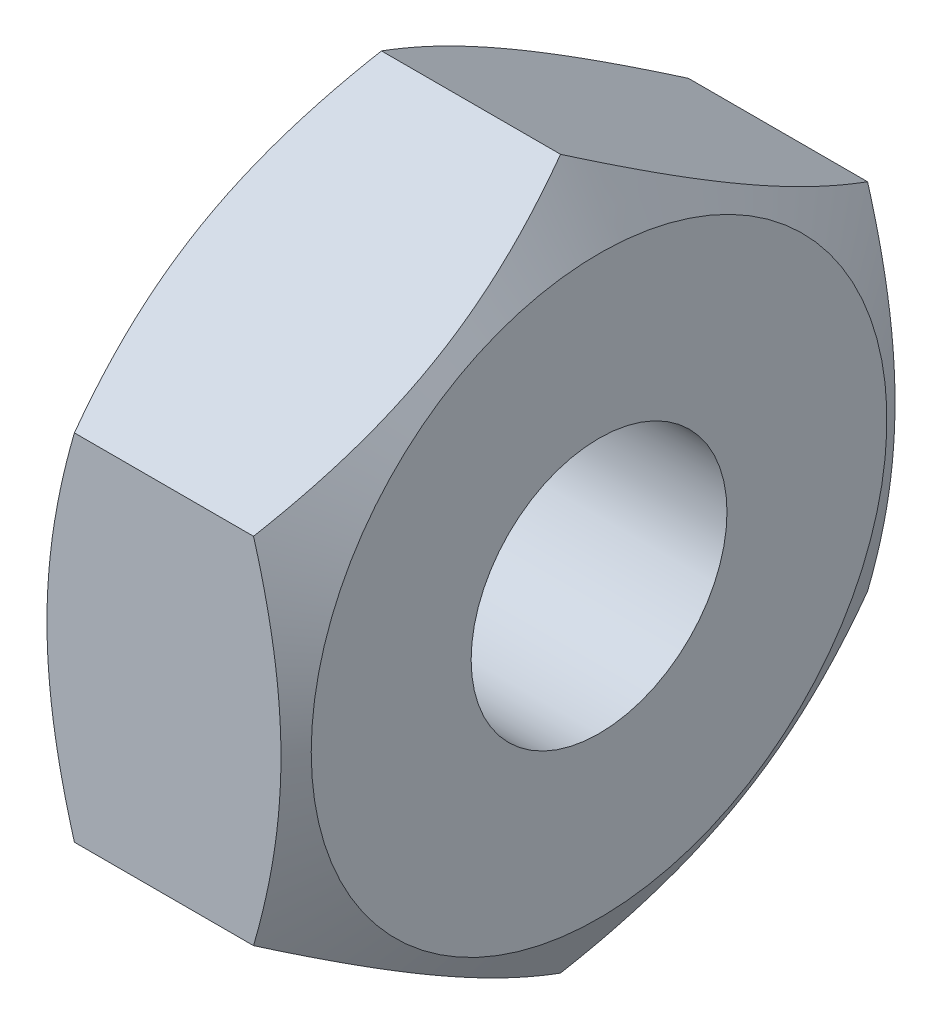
from build123d import *

# Parameters (mm, degrees)
SKETCH_2_OUTSIDE_W  = 37.804
SKETCH_2_OUTSIDE_H  = 37.804
CUT_EXTRUDE_1_DEPTH = 25
SKETCH_3_R          = 5
CUT_EXTRUDE_2_DEPTH = 25


with BuildPart() as part:
    # Sketch 1 → Revolve 1 (revolve)
    with BuildSketch(Plane(origin=(0, 0, 0), x_dir=(1, 0, 0), z_dir=(0, 1, 0)), mode=Mode.PRIVATE) as revolve_1_sk:
        Polygon((0, 0), (10.010176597, 0), (10.010176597, 11.25), (8.505088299, 13.856812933), (1.505088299, 13.856812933), (0, 11.25), align=None)
    revolve(revolve_1_sk.sketch.rotate(Axis((0, 0, 0), (1, 0, 0)), 180), axis=Axis((0, 0, 0), (1, 0, 0)))

    # Sketch 2 outside → Cut-Extrude 1 (cut)
    with BuildSketch(Plane(origin=(0, 0, 0), x_dir=(0, 0, -1), z_dir=(1, 0, 0))):
        Rectangle(SKETCH_2_OUTSIDE_W, SKETCH_2_OUTSIDE_H)
        Polygon((-12, -6.928406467), (-12, 6.928406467), (0, 13.856812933), (12, 6.928406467), (12, -6.928406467), (0, -13.856812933), align=None, mode=Mode.SUBTRACT)
    extrude(amount=CUT_EXTRUDE_1_DEPTH, mode=Mode.SUBTRACT)

    # Sketch 3 → Cut-Extrude 2 (cut)
    with BuildSketch(Plane(origin=(0, 0, 0), x_dir=(0, 0, -1), z_dir=(1, 0, 0))):
        with Locations(Location((0, 0, 0), (0, 0, 180))):
            Circle(SKETCH_3_R)
    extrude(amount=CUT_EXTRUDE_2_DEPTH, mode=Mode.SUBTRACT)


solid = part.part
